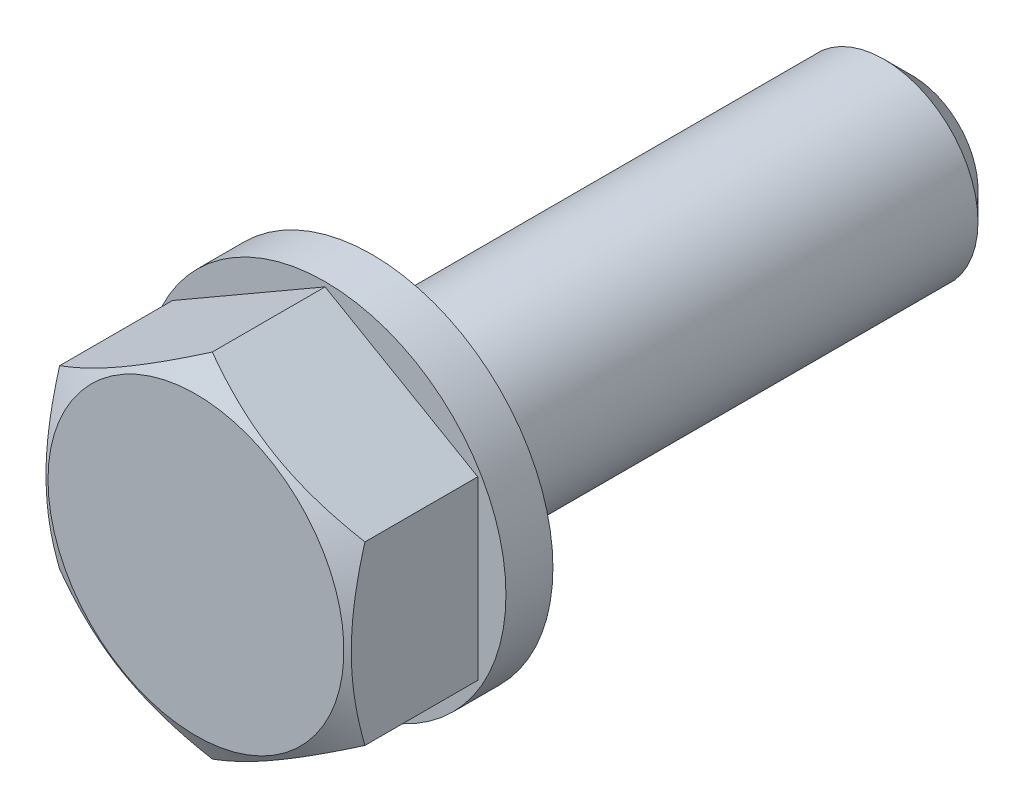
ISO-10303-21;
HEADER;
FILE_DESCRIPTION(('STEP AP214'),'2;1');
FILE_NAME('part.step','',(''),(''),'','','');
FILE_SCHEMA(('AUTOMOTIVE_DESIGN { 1 0 10303 214 1 1 1 1 }'));
ENDSEC;
DATA;
#1=APPLICATION_CONTEXT('core data for automotive mechanical design processes');
#2=APPLICATION_PROTOCOL_DEFINITION('international standard','automotive_design',2000,#1);
#3=PRODUCT_CONTEXT('',#1,'mechanical');
#4=PRODUCT('Part','Part','',(#3));
#5=PRODUCT_RELATED_PRODUCT_CATEGORY('part','',(#4));
#6=PRODUCT_DEFINITION_FORMATION('','',#4);
#7=PRODUCT_DEFINITION_CONTEXT('part definition',#1,'design');
#8=PRODUCT_DEFINITION('design','',#6,#7);
#9=PRODUCT_DEFINITION_SHAPE('','',#8);
#10=(LENGTH_UNIT() NAMED_UNIT(*) SI_UNIT(.MILLI.,.METRE.));
#11=(NAMED_UNIT(*) PLANE_ANGLE_UNIT() SI_UNIT($,.RADIAN.));
#12=(NAMED_UNIT(*) SI_UNIT($,.STERADIAN.) SOLID_ANGLE_UNIT());
#13=UNCERTAINTY_MEASURE_WITH_UNIT(LENGTH_MEASURE(1.E-05),#10,'distance_accuracy_value','');
#14=(GEOMETRIC_REPRESENTATION_CONTEXT(3) GLOBAL_UNCERTAINTY_ASSIGNED_CONTEXT((#13)) GLOBAL_UNIT_ASSIGNED_CONTEXT((#10,
#11,#12)) REPRESENTATION_CONTEXT('',''));
#15=CARTESIAN_POINT('',(0.,0.,0.));
#16=DIRECTION('',(0.,0.,1.));
#17=DIRECTION('',(1.,0.,0.));
#18=AXIS2_PLACEMENT_3D('',#15,#16,#17);
#19=CARTESIAN_POINT('',(0.,7.50555349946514,0.));
#20=DIRECTION('',(0.,0.,1.));
#21=DIRECTION('',(1.,0.,0.));
#22=AXIS2_PLACEMENT_3D('',#19,#20,#21);
#23=PLANE('',#22);
#24=CARTESIAN_POINT('',(0.,0.,0.));
#25=DIRECTION('',(0.,0.,-1.));
#26=DIRECTION('',(-1.,0.,0.));
#27=AXIS2_PLACEMENT_3D('',#24,#25,#26);
#28=CIRCLE('',#27,4.1);
#29=CARTESIAN_POINT('',(-4.1,0.,0.));
#30=VERTEX_POINT('',#29);
#31=EDGE_CURVE('E338',#30,#30,#28,.T.);
#32=ORIENTED_EDGE('',*,*,#31,.T.);
#33=EDGE_LOOP('',(#32));
#34=FACE_BOUND('',#33,.T.);
#35=CARTESIAN_POINT('',(0.,0.,0.));
#36=DIRECTION('',(0.,0.,1.));
#37=DIRECTION('',(1.,0.,0.));
#38=AXIS2_PLACEMENT_3D('',#35,#36,#37);
#39=CIRCLE('',#38,4.);
#40=CARTESIAN_POINT('',(4.,0.,0.));
#41=VERTEX_POINT('',#40);
#42=EDGE_CURVE('E102',#41,#41,#39,.F.);
#43=ORIENTED_EDGE('',*,*,#42,.F.);
#44=EDGE_LOOP('',(#43));
#45=FACE_BOUND('',#44,.T.);
#46=ADVANCED_FACE('F14',(#34,#45),#23,.F.);
#47=CARTESIAN_POINT('',(0.,0.,-25.));
#48=DIRECTION('',(0.,0.,1.));
#49=DIRECTION('',(1.,0.,0.));
#50=AXIS2_PLACEMENT_3D('',#47,#48,#49);
#51=CYLINDRICAL_SURFACE('',#50,4.);
#52=CARTESIAN_POINT('',(0.,0.,-23.8));
#53=DIRECTION('',(0.,0.,-1.));
#54=DIRECTION('',(-1.,0.,0.));
#55=AXIS2_PLACEMENT_3D('',#52,#53,#54);
#56=CIRCLE('',#55,4.);
#57=CARTESIAN_POINT('',(-4.,0.,-23.8));
#58=VERTEX_POINT('',#57);
#59=EDGE_CURVE('E9',#58,#58,#56,.F.);
#60=ORIENTED_EDGE('',*,*,#59,.T.);
#61=EDGE_LOOP('',(#60));
#62=FACE_BOUND('',#61,.T.);
#63=ORIENTED_EDGE('',*,*,#42,.T.);
#64=EDGE_LOOP('',(#63));
#65=FACE_BOUND('',#64,.T.);
#66=ADVANCED_FACE('F120',(#62,#65),#51,.T.);
#67=CARTESIAN_POINT('',(0.,0.,-25.));
#68=DIRECTION('',(0.,0.,-1.));
#69=DIRECTION('',(-1.,0.,0.));
#70=AXIS2_PLACEMENT_3D('',#67,#68,#69);
#71=PLANE('',#70);
#72=CARTESIAN_POINT('',(0.,0.,-25.));
#73=DIRECTION('',(0.,0.,-1.));
#74=DIRECTION('',(-1.,0.,0.));
#75=AXIS2_PLACEMENT_3D('',#72,#73,#74);
#76=CIRCLE('',#75,2.8);
#77=CARTESIAN_POINT('',(-2.8,0.,-25.));
#78=VERTEX_POINT('',#77);
#79=EDGE_CURVE('E22',#78,#78,#76,.T.);
#80=ORIENTED_EDGE('',*,*,#79,.T.);
#81=EDGE_LOOP('',(#80));
#82=FACE_BOUND('',#81,.T.);
#83=ADVANCED_FACE('F107',(#82),#71,.T.);
#84=CARTESIAN_POINT('',(0.,0.,-25.));
#85=DIRECTION('',(0.,0.,1.));
#86=DIRECTION('',(1.,0.,0.));
#87=AXIS2_PLACEMENT_3D('',#84,#85,#86);
#88=CONICAL_SURFACE('',#87,2.8,0.785398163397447);
#89=ORIENTED_EDGE('',*,*,#59,.F.);
#90=EDGE_LOOP('',(#89));
#91=FACE_BOUND('',#90,.T.);
#92=ORIENTED_EDGE('',*,*,#79,.F.);
#93=EDGE_LOOP('',(#92));
#94=FACE_BOUND('',#93,.T.);
#95=ADVANCED_FACE('F16',(#91,#94),#88,.T.);
#96=CARTESIAN_POINT('',(0.,0.,0.));
#97=DIRECTION('',(0.,0.,-1.));
#98=DIRECTION('',(-1.,0.,0.));
#99=AXIS2_PLACEMENT_3D('',#96,#97,#98);
#100=PLANE('',#99);
#101=CARTESIAN_POINT('',(0.,0.,0.));
#102=DIRECTION('',(0.,0.,-1.));
#103=DIRECTION('',(-1.,0.,0.));
#104=AXIS2_PLACEMENT_3D('',#101,#102,#103);
#105=CIRCLE('',#104,7.7);
#106=CARTESIAN_POINT('',(-7.7,0.,0.));
#107=VERTEX_POINT('',#106);
#108=EDGE_CURVE('E337',#107,#107,#105,.T.);
#109=ORIENTED_EDGE('',*,*,#108,.F.);
#110=EDGE_LOOP('',(#109));
#111=FACE_BOUND('',#110,.T.);
#112=DIRECTION('',(-0.866025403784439,-0.5,0.));
#113=VECTOR('',#112,1.);
#114=CARTESIAN_POINT('',(0.,7.50555349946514,0.));
#115=LINE('',#114,#113);
#116=CARTESIAN_POINT('',(0.,7.50555349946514,0.));
#117=VERTEX_POINT('',#116);
#118=CARTESIAN_POINT('',(-6.5,3.75277674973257,0.));
#119=VERTEX_POINT('',#118);
#120=EDGE_CURVE('E210',#117,#119,#115,.T.);
#121=ORIENTED_EDGE('',*,*,#120,.F.);
#122=DIRECTION('',(-0.866025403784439,0.5,0.));
#123=VECTOR('',#122,1.);
#124=CARTESIAN_POINT('',(6.5,3.75277674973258,0.));
#125=LINE('',#124,#123);
#126=CARTESIAN_POINT('',(6.5,3.75277674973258,0.));
#127=VERTEX_POINT('',#126);
#128=EDGE_CURVE('E37',#127,#117,#125,.T.);
#129=ORIENTED_EDGE('',*,*,#128,.F.);
#130=DIRECTION('',(0.,1.,0.));
#131=VECTOR('',#130,1.);
#132=CARTESIAN_POINT('',(6.5,-3.75277674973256,0.));
#133=LINE('',#132,#131);
#134=CARTESIAN_POINT('',(6.5,-3.75277674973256,0.));
#135=VERTEX_POINT('',#134);
#136=EDGE_CURVE('E65',#135,#127,#133,.T.);
#137=ORIENTED_EDGE('',*,*,#136,.F.);
#138=DIRECTION('',(0.866025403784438,0.5,0.));
#139=VECTOR('',#138,1.);
#140=CARTESIAN_POINT('',(0.,-7.50555349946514,0.));
#141=LINE('',#140,#139);
#142=CARTESIAN_POINT('',(0.,-7.50555349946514,0.));
#143=VERTEX_POINT('',#142);
#144=EDGE_CURVE('E69',#143,#135,#141,.T.);
#145=ORIENTED_EDGE('',*,*,#144,.F.);
#146=DIRECTION('',(0.866025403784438,-0.5,0.));
#147=VECTOR('',#146,1.);
#148=CARTESIAN_POINT('',(-6.5,-3.75277674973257,0.));
#149=LINE('',#148,#147);
#150=CARTESIAN_POINT('',(-6.5,-3.75277674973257,0.));
#151=VERTEX_POINT('',#150);
#152=EDGE_CURVE('E85',#151,#143,#149,.T.);
#153=ORIENTED_EDGE('',*,*,#152,.F.);
#154=DIRECTION('',(0.,-1.,0.));
#155=VECTOR('',#154,1.);
#156=CARTESIAN_POINT('',(-6.5,3.75277674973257,0.));
#157=LINE('',#156,#155);
#158=EDGE_CURVE('E87',#119,#151,#157,.T.);
#159=ORIENTED_EDGE('',*,*,#158,.F.);
#160=EDGE_LOOP('',(#121,#129,#137,#145,#153,#159));
#161=FACE_BOUND('',#160,.T.);
#162=ADVANCED_FACE('F67',(#111,#161),#100,.F.);
#163=CARTESIAN_POINT('',(0.,0.,-2.));
#164=DIRECTION('',(0.,0.,-1.));
#165=DIRECTION('',(-1.,0.,0.));
#166=AXIS2_PLACEMENT_3D('',#163,#164,#165);
#167=PLANE('',#166);
#168=CARTESIAN_POINT('',(0.,0.,-2.));
#169=DIRECTION('',(0.,0.,-1.));
#170=DIRECTION('',(-1.,0.,0.));
#171=AXIS2_PLACEMENT_3D('',#168,#169,#170);
#172=CIRCLE('',#171,7.7);
#173=CARTESIAN_POINT('',(-7.7,0.,-2.));
#174=VERTEX_POINT('',#173);
#175=EDGE_CURVE('E333',#174,#174,#172,.T.);
#176=ORIENTED_EDGE('',*,*,#175,.T.);
#177=EDGE_LOOP('',(#176));
#178=FACE_BOUND('',#177,.T.);
#179=CARTESIAN_POINT('',(0.,0.,-2.));
#180=DIRECTION('',(0.,0.,-1.));
#181=DIRECTION('',(-1.,0.,0.));
#182=AXIS2_PLACEMENT_3D('',#179,#180,#181);
#183=CIRCLE('',#182,4.1);
#184=CARTESIAN_POINT('',(-4.1,0.,-2.));
#185=VERTEX_POINT('',#184);
#186=EDGE_CURVE('E336',#185,#185,#183,.T.);
#187=ORIENTED_EDGE('',*,*,#186,.F.);
#188=EDGE_LOOP('',(#187));
#189=FACE_BOUND('',#188,.T.);
#190=ADVANCED_FACE('F117',(#178,#189),#167,.T.);
#191=CARTESIAN_POINT('',(0.,0.,-2.));
#192=DIRECTION('',(0.,0.,1.));
#193=DIRECTION('',(1.,0.,0.));
#194=AXIS2_PLACEMENT_3D('',#191,#192,#193);
#195=CYLINDRICAL_SURFACE('',#194,7.7);
#196=ORIENTED_EDGE('',*,*,#175,.F.);
#197=EDGE_LOOP('',(#196));
#198=FACE_BOUND('',#197,.T.);
#199=ORIENTED_EDGE('',*,*,#108,.T.);
#200=EDGE_LOOP('',(#199));
#201=FACE_BOUND('',#200,.T.);
#202=ADVANCED_FACE('F260',(#198,#201),#195,.T.);
#203=CARTESIAN_POINT('',(0.,0.,-2.));
#204=DIRECTION('',(0.,0.,1.));
#205=DIRECTION('',(1.,0.,0.));
#206=AXIS2_PLACEMENT_3D('',#203,#204,#205);
#207=CYLINDRICAL_SURFACE('',#206,4.1);
#208=ORIENTED_EDGE('',*,*,#186,.T.);
#209=EDGE_LOOP('',(#208));
#210=FACE_BOUND('',#209,.T.);
#211=ORIENTED_EDGE('',*,*,#31,.F.);
#212=EDGE_LOOP('',(#211));
#213=FACE_BOUND('',#212,.T.);
#214=ADVANCED_FACE('F252',(#210,#213),#207,.F.);
#215=CARTESIAN_POINT('',(0.,7.50555349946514,5.5));
#216=DIRECTION('',(0.,0.,1.));
#217=DIRECTION('',(1.,0.,0.));
#218=AXIS2_PLACEMENT_3D('',#215,#216,#217);
#219=PLANE('',#218);
#220=CARTESIAN_POINT('',(0.,0.,5.5));
#221=DIRECTION('',(0.,0.,-1.));
#222=DIRECTION('',(-1.,0.,0.));
#223=AXIS2_PLACEMENT_3D('',#220,#221,#222);
#224=CIRCLE('',#223,6.3);
#225=CARTESIAN_POINT('',(-6.3,0.,5.5));
#226=VERTEX_POINT('',#225);
#227=EDGE_CURVE('E151',#226,#226,#224,.T.);
#228=ORIENTED_EDGE('',*,*,#227,.F.);
#229=EDGE_LOOP('',(#228));
#230=FACE_BOUND('',#229,.T.);
#231=ADVANCED_FACE('F136',(#230),#219,.T.);
#232=CARTESIAN_POINT('',(0.,0.,5.5));
#233=DIRECTION('',(0.,0.,-1.));
#234=DIRECTION('',(-1.,0.,0.));
#235=AXIS2_PLACEMENT_3D('',#232,#233,#234);
#236=CONICAL_SURFACE('',#235,6.3,1.0471975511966);
#237=ORIENTED_EDGE('',*,*,#227,.T.);
#238=EDGE_LOOP('',(#237));
#239=FACE_BOUND('',#238,.T.);
#240=CARTESIAN_POINT('',(-6.5002,3.75266127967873,4.80390669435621));
#241=CARTESIAN_POINT('',(-6.35732254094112,3.83515161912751,4.85152552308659));
#242=CARTESIAN_POINT('',(-6.21391236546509,3.91794952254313,4.89698324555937));
#243=CARTESIAN_POINT('',(-5.92592736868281,4.08421773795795,4.98298126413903));
#244=CARTESIAN_POINT('',(-5.78135207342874,4.16768832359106,5.02351943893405));
#245=CARTESIAN_POINT('',(-5.34531134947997,4.41943655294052,5.13695894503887));
#246=CARTESIAN_POINT('',(-5.05212471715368,4.5887079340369,5.20148213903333));
#247=CARTESIAN_POINT('',(-4.61337625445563,4.84201947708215,5.27714336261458));
#248=CARTESIAN_POINT('',(-4.46912536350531,4.92530276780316,5.29869708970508));
#249=CARTESIAN_POINT('',(-4.17997178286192,5.09224566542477,5.33483963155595));
#250=CARTESIAN_POINT('',(-4.03506915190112,5.17590523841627,5.34942906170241));
#251=CARTESIAN_POINT('',(-3.74501222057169,5.34336968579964,5.37127119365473));
#252=CARTESIAN_POINT('',(-3.5998583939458,5.427174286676,5.37853222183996));
#253=CARTESIAN_POINT('',(-3.30942466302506,5.59485627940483,5.38556964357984));
#254=CARTESIAN_POINT('',(-3.16414476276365,5.6787336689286,5.38534626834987));
#255=CARTESIAN_POINT('',(-2.76612405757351,5.90853103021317,5.37444648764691));
#256=CARTESIAN_POINT('',(-2.51351353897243,6.05437578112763,5.35614812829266));
#257=CARTESIAN_POINT('',(-2.00997032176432,6.34509659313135,5.2981236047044));
#258=CARTESIAN_POINT('',(-1.75903939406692,6.48997163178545,5.25837760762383));
#259=CARTESIAN_POINT('',(-1.25448277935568,6.78127752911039,5.15902404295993));
#260=CARTESIAN_POINT('',(-1.00092075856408,6.92767163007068,5.09899552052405));
#261=CARTESIAN_POINT('',(-0.497578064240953,7.21827667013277,4.9627549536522));
#262=CARTESIAN_POINT('',(-0.247790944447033,7.36249133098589,4.88657491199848));
#263=CARTESIAN_POINT('',(0.000200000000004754,7.50566896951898,4.80390669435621));
#264=B_SPLINE_CURVE_WITH_KNOTS('',3,(#240,#241,#242,#243,#244,#245,#246,#247,#248,#249,#250,
#251,#252,#253,#254,#255,#256,#257,#258,#259,#260,#261,#262,#263),.UNSPECIFIED.,.F.,.F.,(4,2,2,
2,2,2,2,2,2,2,2,4),(0.,0.515105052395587,1.03043143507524,2.06322554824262,2.56697389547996,
3.07067772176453,3.57380860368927,4.07692394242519,4.9527935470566,5.82947446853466,
6.72559912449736,7.61996451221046),.UNSPECIFIED.);
#265=CARTESIAN_POINT('',(-6.5,3.75277674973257,4.80397336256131));
#266=VERTEX_POINT('',#265);
#267=CARTESIAN_POINT('',(0.,7.50555349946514,4.80397336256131));
#268=VERTEX_POINT('',#267);
#269=EDGE_CURVE('E180',#266,#268,#264,.T.);
#270=ORIENTED_EDGE('',*,*,#269,.F.);
#271=CARTESIAN_POINT('',(-6.5,-10.0121745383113,2.24543614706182));
#272=CARTESIAN_POINT('',(-6.5,-9.72884077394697,2.38260259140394));
#273=CARTESIAN_POINT('',(-6.50000000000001,-9.44484920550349,2.51843391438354));
#274=CARTESIAN_POINT('',(-6.50000000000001,-8.87520038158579,2.7866740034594));
#275=CARTESIAN_POINT('',(-6.50000000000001,-8.58954286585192,2.91908221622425));
#276=CARTESIAN_POINT('',(-6.50000000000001,-8.01470725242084,3.18040459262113));
#277=CARTESIAN_POINT('',(-6.50000000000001,-7.72551840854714,3.30929520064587));
#278=CARTESIAN_POINT('',(-6.50000000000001,-7.14481653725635,3.56170967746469));
#279=CARTESIAN_POINT('',(-6.5,-6.85330362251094,3.68523380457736));
#280=CARTESIAN_POINT('',(-6.5,-6.25835021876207,3.92924476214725));
#281=CARTESIAN_POINT('',(-6.5,-5.95482118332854,4.0495168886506));
#282=CARTESIAN_POINT('',(-6.5,-5.34418660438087,4.28079198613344));
#283=CARTESIAN_POINT('',(-6.5,-5.03708066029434,4.39179390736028));
#284=CARTESIAN_POINT('',(-6.5,-4.41940212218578,4.6015647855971));
#285=CARTESIAN_POINT('',(-6.5,-4.10883822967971,4.70035910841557));
#286=CARTESIAN_POINT('',(-6.5,-3.48325330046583,4.88249853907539));
#287=CARTESIAN_POINT('',(-6.5,-3.1682337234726,4.96584858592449));
#288=CARTESIAN_POINT('',(-6.5,-2.53530790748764,5.11261969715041));
#289=CARTESIAN_POINT('',(-6.5,-2.21742650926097,5.1761461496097));
#290=CARTESIAN_POINT('',(-6.5,-1.57773861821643,5.27961655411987));
#291=CARTESIAN_POINT('',(-6.5,-1.25593247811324,5.31956260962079));
#292=CARTESIAN_POINT('',(-6.5,-0.773694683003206,5.35914225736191));
#293=CARTESIAN_POINT('',(-6.5,-0.614056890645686,5.36894628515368));
#294=CARTESIAN_POINT('',(-6.5,-0.294502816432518,5.38180549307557));
#295=CARTESIAN_POINT('',(-6.5,-0.134586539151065,5.38486078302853));
#296=CARTESIAN_POINT('',(-6.5,0.185230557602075,5.38414215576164));
#297=CARTESIAN_POINT('',(-6.5,0.345131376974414,5.38036819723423));
#298=CARTESIAN_POINT('',(-6.5,0.664634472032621,5.36608412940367));
#299=CARTESIAN_POINT('',(-6.5,0.824236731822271,5.35557367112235));
#300=CARTESIAN_POINT('',(-6.5,1.20990407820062,5.32225600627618));
#301=CARTESIAN_POINT('',(-6.5,1.43568874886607,5.29613611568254));
#302=CARTESIAN_POINT('',(-6.5,1.885526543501,5.23185497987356));
#303=CARTESIAN_POINT('',(-6.5,2.10957941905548,5.19369203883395));
#304=CARTESIAN_POINT('',(-6.5,2.77891557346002,5.06316700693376));
#305=CARTESIAN_POINT('',(-6.5,3.22111483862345,4.95479423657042));
#306=CARTESIAN_POINT('',(-6.5,3.88223039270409,4.76757229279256));
#307=CARTESIAN_POINT('',(-6.5,4.10459338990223,4.70020011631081));
#308=CARTESIAN_POINT('',(-6.5,4.54715853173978,4.55863430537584));
#309=CARTESIAN_POINT('',(-6.5,4.767360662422,4.48444062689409));
#310=CARTESIAN_POINT('',(-6.5,5.20567675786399,4.33040752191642));
#311=CARTESIAN_POINT('',(-6.5,5.42379142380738,4.25057007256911));
#312=CARTESIAN_POINT('',(-6.5,5.85822557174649,4.08617118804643));
#313=CARTESIAN_POINT('',(-6.5,6.07454507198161,4.0016098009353));
#314=CARTESIAN_POINT('',(-6.5,6.5732891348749,3.80137016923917));
#315=CARTESIAN_POINT('',(-6.5,6.85513768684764,3.68426014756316));
#316=CARTESIAN_POINT('',(-6.5,7.41653666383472,3.44464123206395));
#317=CARTESIAN_POINT('',(-6.5,7.69608696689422,3.32213205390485));
#318=CARTESIAN_POINT('',(-6.5,8.25329746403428,3.07276664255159));
#319=CARTESIAN_POINT('',(-6.5,8.5309573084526,2.94590963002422));
#320=CARTESIAN_POINT('',(-6.5,9.08465216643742,2.6886919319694));
#321=CARTESIAN_POINT('',(-6.5,9.36068714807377,2.5583311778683));
#322=CARTESIAN_POINT('',(-6.5,9.91163626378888,2.29462745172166));
#323=CARTESIAN_POINT('',(-6.5,10.1865491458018,2.16128186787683));
#324=CARTESIAN_POINT('',(-6.5,10.7352128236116,1.89221900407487));
#325=CARTESIAN_POINT('',(-6.5,11.0089636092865,1.75650170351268));
#326=CARTESIAN_POINT('',(-6.5,11.8287554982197,1.3464007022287));
#327=CARTESIAN_POINT('',(-6.5,12.3733247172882,1.0690734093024));
#328=CARTESIAN_POINT('',(-6.5,13.1662023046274,0.660151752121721));
#329=CARTESIAN_POINT('',(-6.5,13.4156505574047,0.530753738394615));
#330=CARTESIAN_POINT('',(-6.5,13.9140050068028,0.270927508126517));
#331=CARTESIAN_POINT('',(-6.49999999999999,14.1629112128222,0.140499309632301));
#332=CARTESIAN_POINT('',(-6.49999999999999,14.9089444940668,-0.252133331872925));
#333=CARTESIAN_POINT('',(-6.49999999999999,15.4053671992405,-0.515675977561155));
#334=CARTESIAN_POINT('',(-6.49999999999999,16.3956060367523,-1.0448805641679));
#335=CARTESIAN_POINT('',(-6.49999999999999,16.8894255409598,-1.31053620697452));
#336=CARTESIAN_POINT('',(-6.49999999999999,17.8758673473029,-1.8440018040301));
#337=CARTESIAN_POINT('',(-6.5,18.3684897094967,-2.11181164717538));
#338=CARTESIAN_POINT('',(-6.5,18.8606678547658,-2.3804302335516));
#339=B_SPLINE_CURVE_WITH_KNOTS('',3,(#271,#272,#273,#274,#275,#276,#277,#278,#279,#280,#281,
#282,#283,#284,#285,#286,#287,#288,#289,#290,#291,#292,#293,#294,#295,#296,#297,#298,#299,#300,
#301,#302,#303,#304,#305,#306,#307,#308,#309,#310,#311,#312,#313,#314,#315,#316,#317,#318,#319,
#320,#321,#322,#323,#324,#325,#326,#327,#328,#329,#330,#331,#332,#333,#334,#335,#336,#337,#338),
.UNSPECIFIED.,.F.,.F.,(4,2,2,2,2,2,2,2,2,2,2,2,2,2,2,2,2,2,2,2,2,2,2,2,2,2,2,2,2,2,2,2,2,4),(0.,
0.944381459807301,1.88891463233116,2.83870615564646,3.78845190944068,4.76780293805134,
5.74726471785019,6.72465579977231,7.70173377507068,8.67352515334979,9.64522983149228,
10.1249245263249,10.6046114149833,11.0843012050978,11.5640158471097,12.2455009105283,
12.9270819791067,14.291028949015,14.9880088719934,15.6849932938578,16.3817347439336,
17.0784691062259,17.9940256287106,18.9096304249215,19.8254002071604,20.741187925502,
21.6578109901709,22.5744420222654,24.4077421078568,25.2507801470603,26.0938034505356,
27.779914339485,29.4621322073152,31.1442638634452),.UNSPECIFIED.);
#340=CARTESIAN_POINT('',(-6.5,-3.75277674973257,4.80397336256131));
#341=VERTEX_POINT('',#340);
#342=EDGE_CURVE('E173',#341,#266,#339,.T.);
#343=ORIENTED_EDGE('',*,*,#342,.F.);
#344=CARTESIAN_POINT('',(0.000199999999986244,-7.50566896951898,4.80390669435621));
#345=CARTESIAN_POINT('',(-0.142677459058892,-7.4231786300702,4.85152552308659));
#346=CARTESIAN_POINT('',(-0.286087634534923,-7.34038072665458,4.89698324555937));
#347=CARTESIAN_POINT('',(-0.574072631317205,-7.17411251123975,4.98298126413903));
#348=CARTESIAN_POINT('',(-0.718647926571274,-7.09064192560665,5.02351943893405));
#349=CARTESIAN_POINT('',(-1.15468865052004,-6.83889369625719,5.13695894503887));
#350=CARTESIAN_POINT('',(-1.44787528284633,-6.6696223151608,5.20148213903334));
#351=CARTESIAN_POINT('',(-1.88662374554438,-6.41631077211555,5.27714336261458));
#352=CARTESIAN_POINT('',(-2.0308746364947,-6.33302748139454,5.29869708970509));
#353=CARTESIAN_POINT('',(-2.3200282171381,-6.16608458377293,5.33483963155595));
#354=CARTESIAN_POINT('',(-2.4649308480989,-6.08242501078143,5.34942906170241));
#355=CARTESIAN_POINT('',(-2.75498777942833,-5.91496056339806,5.37127119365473));
#356=CARTESIAN_POINT('',(-2.90014160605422,-5.8311559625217,5.37853222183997));
#357=CARTESIAN_POINT('',(-3.19057533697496,-5.66347396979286,5.38556964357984));
#358=CARTESIAN_POINT('',(-3.33585523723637,-5.5795965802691,5.38534626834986));
#359=CARTESIAN_POINT('',(-3.73387594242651,-5.34979921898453,5.3744464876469));
#360=CARTESIAN_POINT('',(-3.98648646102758,-5.20395446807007,5.35614812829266));
#361=CARTESIAN_POINT('',(-4.49002967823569,-4.91323365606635,5.2981236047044));
#362=CARTESIAN_POINT('',(-4.74096060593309,-4.76835861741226,5.25837760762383));
#363=CARTESIAN_POINT('',(-5.24551722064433,-4.47705272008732,5.15902404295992));
#364=CARTESIAN_POINT('',(-5.49907924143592,-4.33065861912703,5.09899552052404));
#365=CARTESIAN_POINT('',(-6.00242193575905,-4.04005357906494,4.96275495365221));
#366=CARTESIAN_POINT('',(-6.25220905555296,-3.89583891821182,4.88657491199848));
#367=CARTESIAN_POINT('',(-6.5002,-3.75266127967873,4.80390669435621));
#368=B_SPLINE_CURVE_WITH_KNOTS('',3,(#344,#345,#346,#347,#348,#349,#350,#351,#352,#353,#354,
#355,#356,#357,#358,#359,#360,#361,#362,#363,#364,#365,#366,#367),.UNSPECIFIED.,.F.,.F.,(4,2,2,
2,2,2,2,2,2,2,2,4),(0.,0.515105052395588,1.03043143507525,2.06322554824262,2.56697389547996,
3.07067772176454,3.57380860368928,4.0769239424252,4.9527935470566,5.82947446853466,
6.72559912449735,7.61996451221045),.UNSPECIFIED.);
#369=CARTESIAN_POINT('',(0.,-7.50555349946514,4.80397336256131));
#370=VERTEX_POINT('',#369);
#371=EDGE_CURVE('E167',#370,#341,#368,.T.);
#372=ORIENTED_EDGE('',*,*,#371,.F.);
#373=CARTESIAN_POINT('',(6.5002,-3.75266127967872,4.80390669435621));
#374=CARTESIAN_POINT('',(6.35732254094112,-3.8351516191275,4.85152552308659));
#375=CARTESIAN_POINT('',(6.21391236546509,-3.91794952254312,4.89698324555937));
#376=CARTESIAN_POINT('',(5.92592736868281,-4.08421773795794,4.98298126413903));
#377=CARTESIAN_POINT('',(5.78135207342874,-4.16768832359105,5.02351943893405));
#378=CARTESIAN_POINT('',(5.34531134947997,-4.41943655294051,5.13695894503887));
#379=CARTESIAN_POINT('',(5.05212471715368,-4.58870793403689,5.20148213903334));
#380=CARTESIAN_POINT('',(4.61337625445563,-4.84201947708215,5.27714336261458));
#381=CARTESIAN_POINT('',(4.46912536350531,-4.92530276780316,5.29869708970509));
#382=CARTESIAN_POINT('',(4.17997178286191,-5.09224566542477,5.33483963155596));
#383=CARTESIAN_POINT('',(4.03506915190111,-5.17590523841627,5.34942906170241));
#384=CARTESIAN_POINT('',(3.74501222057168,-5.34336968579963,5.37127119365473));
#385=CARTESIAN_POINT('',(3.59985839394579,-5.42717428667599,5.37853222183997));
#386=CARTESIAN_POINT('',(3.30942466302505,-5.59485627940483,5.38556964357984));
#387=CARTESIAN_POINT('',(3.16414476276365,-5.6787336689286,5.38534626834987));
#388=CARTESIAN_POINT('',(2.76612405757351,-5.90853103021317,5.37444648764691));
#389=CARTESIAN_POINT('',(2.51351353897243,-6.05437578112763,5.35614812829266));
#390=CARTESIAN_POINT('',(2.00997032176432,-6.34509659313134,5.2981236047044));
#391=CARTESIAN_POINT('',(1.75903939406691,-6.48997163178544,5.25837760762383));
#392=CARTESIAN_POINT('',(1.25448277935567,-6.78127752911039,5.15902404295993));
#393=CARTESIAN_POINT('',(1.00092075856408,-6.92767163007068,5.09899552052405));
#394=CARTESIAN_POINT('',(0.497578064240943,-7.21827667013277,4.9627549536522));
#395=CARTESIAN_POINT('',(0.247790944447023,-7.36249133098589,4.88657491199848));
#396=CARTESIAN_POINT('',(-0.000200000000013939,-7.50566896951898,4.80390669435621));
#397=B_SPLINE_CURVE_WITH_KNOTS('',3,(#373,#374,#375,#376,#377,#378,#379,#380,#381,#382,#383,
#384,#385,#386,#387,#388,#389,#390,#391,#392,#393,#394,#395,#396),.UNSPECIFIED.,.F.,.F.,(4,2,2,
2,2,2,2,2,2,2,2,4),(0.,0.515105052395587,1.03043143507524,2.06322554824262,2.56697389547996,
3.07067772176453,3.57380860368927,4.0769239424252,4.9527935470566,5.82947446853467,
6.72559912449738,7.61996451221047),.UNSPECIFIED.);
#398=CARTESIAN_POINT('',(6.5,-3.75277674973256,4.80397336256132));
#399=VERTEX_POINT('',#398);
#400=EDGE_CURVE('E29',#399,#370,#397,.T.);
#401=ORIENTED_EDGE('',*,*,#400,.F.);
#402=CARTESIAN_POINT('',(6.5,-10.012174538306,2.24543614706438));
#403=CARTESIAN_POINT('',(6.5,-9.72884077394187,2.38260259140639));
#404=CARTESIAN_POINT('',(6.5,-9.44484920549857,2.51843391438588));
#405=CARTESIAN_POINT('',(6.5,-8.87520038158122,2.78667400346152));
#406=CARTESIAN_POINT('',(6.5,-8.58954286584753,2.91908221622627));
#407=CARTESIAN_POINT('',(6.5,-8.01470725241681,3.18040459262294));
#408=CARTESIAN_POINT('',(6.5,-7.72551840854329,3.30929520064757));
#409=CARTESIAN_POINT('',(6.5,-7.14481653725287,3.56170967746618));
#410=CARTESIAN_POINT('',(6.5,-6.85330362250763,3.68523380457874));
#411=CARTESIAN_POINT('',(6.5,-6.25835021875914,3.92924476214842));
#412=CARTESIAN_POINT('',(6.5,-5.95482118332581,4.04951688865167));
#413=CARTESIAN_POINT('',(6.5,-5.34418660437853,4.2807919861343));
#414=CARTESIAN_POINT('',(6.5,-5.0370806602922,4.39179390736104));
#415=CARTESIAN_POINT('',(6.5,-4.41940212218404,4.60156478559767));
#416=CARTESIAN_POINT('',(6.5,-4.10883822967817,4.70035910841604));
#417=CARTESIAN_POINT('',(6.5,-3.4832533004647,4.8824985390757));
#418=CARTESIAN_POINT('',(6.5,-3.16823372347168,4.96584858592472));
#419=CARTESIAN_POINT('',(6.5,-2.53530790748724,5.11261969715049));
#420=CARTESIAN_POINT('',(6.5,-2.21742650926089,5.17614614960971));
#421=CARTESIAN_POINT('',(6.5,-1.57773861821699,5.27961655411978));
#422=CARTESIAN_POINT('',(6.5,-1.25593247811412,5.31956260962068));
#423=CARTESIAN_POINT('',(6.5,-0.773694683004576,5.35914225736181));
#424=CARTESIAN_POINT('',(6.5,-0.614056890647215,5.3689462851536));
#425=CARTESIAN_POINT('',(6.5,-0.294502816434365,5.38180549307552));
#426=CARTESIAN_POINT('',(6.5,-0.134586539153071,5.3848607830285));
#427=CARTESIAN_POINT('',(6.5,0.185230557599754,5.38414215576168));
#428=CARTESIAN_POINT('',(6.5,0.345131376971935,5.3803681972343));
#429=CARTESIAN_POINT('',(6.5,0.66463447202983,5.36608412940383));
#430=CARTESIAN_POINT('',(6.5,0.824236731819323,5.35557367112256));
#431=CARTESIAN_POINT('',(6.5,1.20990407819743,5.32225600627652));
#432=CARTESIAN_POINT('',(6.5,1.43568874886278,5.29613611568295));
#433=CARTESIAN_POINT('',(6.5,1.88552654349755,5.23185497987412));
#434=CARTESIAN_POINT('',(6.5,2.10957941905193,5.19369203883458));
#435=CARTESIAN_POINT('',(6.5,2.77891557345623,5.06316700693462));
#436=CARTESIAN_POINT('',(6.5,3.2211148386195,4.95479423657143));
#437=CARTESIAN_POINT('',(6.5,3.8822303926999,4.76757229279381));
#438=CARTESIAN_POINT('',(6.5,4.10459338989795,4.70020011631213));
#439=CARTESIAN_POINT('',(6.5,4.54715853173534,4.55863430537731));
#440=CARTESIAN_POINT('',(6.5,4.76736066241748,4.48444062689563));
#441=CARTESIAN_POINT('',(6.5,5.2056767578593,4.33040752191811));
#442=CARTESIAN_POINT('',(6.5,5.42379142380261,4.25057007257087));
#443=CARTESIAN_POINT('',(6.5,5.85822557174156,4.08617118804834));
#444=CARTESIAN_POINT('',(6.5,6.0745450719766,4.00160980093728));
#445=CARTESIAN_POINT('',(6.5,6.57328913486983,3.80137016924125));
#446=CARTESIAN_POINT('',(6.5,6.8551376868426,3.68426014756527));
#447=CARTESIAN_POINT('',(6.5,7.41653666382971,3.44464123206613));
#448=CARTESIAN_POINT('',(6.5,7.69608696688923,3.32213205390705));
#449=CARTESIAN_POINT('',(6.5,8.25329746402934,3.07276664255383));
#450=CARTESIAN_POINT('',(6.5,8.53095730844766,2.94590963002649));
#451=CARTESIAN_POINT('',(6.5,9.08465216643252,2.68869193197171));
#452=CARTESIAN_POINT('',(6.5,9.36068714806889,2.55833117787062));
#453=CARTESIAN_POINT('',(6.5,9.91163626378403,2.29462745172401));
#454=CARTESIAN_POINT('',(6.5,10.186549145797,2.16128186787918));
#455=CARTESIAN_POINT('',(6.5,10.7352128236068,1.89221900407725));
#456=CARTESIAN_POINT('',(6.5,11.0089636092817,1.75650170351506));
#457=CARTESIAN_POINT('',(6.5,11.8287554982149,1.34640070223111));
#458=CARTESIAN_POINT('',(6.5,12.3733247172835,1.06907340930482));
#459=CARTESIAN_POINT('',(6.5,13.1662023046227,0.660151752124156));
#460=CARTESIAN_POINT('',(6.5,13.4156505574,0.530753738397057));
#461=CARTESIAN_POINT('',(6.5,13.9140050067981,0.270927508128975));
#462=CARTESIAN_POINT('',(6.5,14.1629112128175,0.140499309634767));
#463=CARTESIAN_POINT('',(6.5,14.9089444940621,-0.252133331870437));
#464=CARTESIAN_POINT('',(6.5,15.4053671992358,-0.515675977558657));
#465=CARTESIAN_POINT('',(6.5,16.3956060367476,-1.04488056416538));
#466=CARTESIAN_POINT('',(6.5,16.8894255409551,-1.31053620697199));
#467=CARTESIAN_POINT('',(6.5,17.8758673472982,-1.84400180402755));
#468=CARTESIAN_POINT('',(6.5,18.368489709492,-2.11181164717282));
#469=CARTESIAN_POINT('',(6.5,18.8606678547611,-2.38043023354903));
#470=B_SPLINE_CURVE_WITH_KNOTS('',3,(#402,#403,#404,#405,#406,#407,#408,#409,#410,#411,#412,
#413,#414,#415,#416,#417,#418,#419,#420,#421,#422,#423,#424,#425,#426,#427,#428,#429,#430,#431,
#432,#433,#434,#435,#436,#437,#438,#439,#440,#441,#442,#443,#444,#445,#446,#447,#448,#449,#450,
#451,#452,#453,#454,#455,#456,#457,#458,#459,#460,#461,#462,#463,#464,#465,#466,#467,#468,#469),
.UNSPECIFIED.,.F.,.F.,(4,2,2,2,2,2,2,2,2,2,2,2,2,2,2,2,2,2,2,2,2,2,2,2,2,2,2,2,2,2,2,2,2,4),(0.,
0.94438145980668,1.88891463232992,2.8387061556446,3.78845190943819,4.76780293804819,
5.74726471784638,6.72465579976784,7.70173377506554,8.67352515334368,9.6452298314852,
10.1249245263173,10.6046114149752,11.0843012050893,11.5640158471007,12.245500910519,
12.9270819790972,14.2910289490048,14.9880088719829,15.684993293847,16.3817347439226,
17.0784691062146,17.9940256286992,18.9096304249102,19.8254002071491,20.7411879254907,
21.6578109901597,22.5744420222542,24.4077421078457,25.2507801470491,26.0938034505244,
27.7799143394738,29.462132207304,31.144263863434),.UNSPECIFIED.);
#471=CARTESIAN_POINT('',(6.5,3.75277674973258,4.80397336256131));
#472=VERTEX_POINT('',#471);
#473=EDGE_CURVE('E78',#472,#399,#470,.F.);
#474=ORIENTED_EDGE('',*,*,#473,.F.);
#475=CARTESIAN_POINT('',(-0.00019999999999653,7.50566896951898,4.80390669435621));
#476=CARTESIAN_POINT('',(0.142677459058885,7.42317863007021,4.85152552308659));
#477=CARTESIAN_POINT('',(0.286087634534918,7.34038072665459,4.89698324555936));
#478=CARTESIAN_POINT('',(0.5740726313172,7.17411251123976,4.98298126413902));
#479=CARTESIAN_POINT('',(0.718647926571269,7.09064192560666,5.02351943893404));
#480=CARTESIAN_POINT('',(1.15468865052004,6.8388936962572,5.13695894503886));
#481=CARTESIAN_POINT('',(1.44787528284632,6.66962231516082,5.20148213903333));
#482=CARTESIAN_POINT('',(1.88662374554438,6.41631077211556,5.27714336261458));
#483=CARTESIAN_POINT('',(2.0308746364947,6.33302748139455,5.29869708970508));
#484=CARTESIAN_POINT('',(2.32002821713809,6.16608458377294,5.33483963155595));
#485=CARTESIAN_POINT('',(2.46493084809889,6.08242501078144,5.3494290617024));
#486=CARTESIAN_POINT('',(2.75498777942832,5.91496056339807,5.37127119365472));
#487=CARTESIAN_POINT('',(2.90014160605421,5.83115596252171,5.37853222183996));
#488=CARTESIAN_POINT('',(3.19057533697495,5.66347396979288,5.38556964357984));
#489=CARTESIAN_POINT('',(3.33585523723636,5.57959658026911,5.38534626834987));
#490=CARTESIAN_POINT('',(3.7338759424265,5.34979921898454,5.37444648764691));
#491=CARTESIAN_POINT('',(3.98648646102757,5.20395446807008,5.35614812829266));
#492=CARTESIAN_POINT('',(4.49002967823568,4.91323365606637,5.29812360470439));
#493=CARTESIAN_POINT('',(4.74096060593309,4.76835861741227,5.25837760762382));
#494=CARTESIAN_POINT('',(5.24551722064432,4.47705272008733,5.15902404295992));
#495=CARTESIAN_POINT('',(5.49907924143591,4.33065861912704,5.09899552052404));
#496=CARTESIAN_POINT('',(6.00242193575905,4.04005357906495,4.9627549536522));
#497=CARTESIAN_POINT('',(6.25220905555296,3.89583891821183,4.88657491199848));
#498=CARTESIAN_POINT('',(6.5002,3.75266127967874,4.80390669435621));
#499=B_SPLINE_CURVE_WITH_KNOTS('',3,(#475,#476,#477,#478,#479,#480,#481,#482,#483,#484,#485,
#486,#487,#488,#489,#490,#491,#492,#493,#494,#495,#496,#497,#498),.UNSPECIFIED.,.F.,.F.,(4,2,2,
2,2,2,2,2,2,2,2,4),(0.,0.515105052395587,1.03043143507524,2.06322554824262,2.56697389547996,
3.07067772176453,3.57380860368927,4.0769239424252,4.9527935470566,5.82947446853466,
6.72559912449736,7.61996451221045),.UNSPECIFIED.);
#500=EDGE_CURVE('E187',#268,#472,#499,.T.);
#501=ORIENTED_EDGE('',*,*,#500,.F.);
#502=EDGE_LOOP('',(#270,#343,#372,#401,#474,#501));
#503=FACE_BOUND('',#502,.T.);
#504=ADVANCED_FACE('F141',(#239,#503),#236,.T.);
#505=CARTESIAN_POINT('',(6.5,-3.75277674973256,5.5));
#506=DIRECTION('',(-1.,0.,0.));
#507=DIRECTION('',(0.,0.,1.));
#508=AXIS2_PLACEMENT_3D('',#505,#506,#507);
#509=PLANE('',#508);
#510=DIRECTION('',(0.,0.,-1.));
#511=VECTOR('',#510,1.);
#512=CARTESIAN_POINT('',(6.5,3.75277674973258,5.5));
#513=LINE('',#512,#511);
#514=EDGE_CURVE('E73',#472,#127,#513,.T.);
#515=ORIENTED_EDGE('',*,*,#514,.F.);
#516=ORIENTED_EDGE('',*,*,#473,.T.);
#517=DIRECTION('',(0.,0.,-1.));
#518=VECTOR('',#517,1.);
#519=CARTESIAN_POINT('',(6.5,-3.75277674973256,5.5));
#520=LINE('',#519,#518);
#521=EDGE_CURVE('E76',#399,#135,#520,.T.);
#522=ORIENTED_EDGE('',*,*,#521,.T.);
#523=ORIENTED_EDGE('',*,*,#136,.T.);
#524=EDGE_LOOP('',(#515,#516,#522,#523));
#525=FACE_BOUND('',#524,.T.);
#526=ADVANCED_FACE('F77',(#525),#509,.F.);
#527=CARTESIAN_POINT('',(0.,-7.50555349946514,5.5));
#528=DIRECTION('',(-0.5,0.866025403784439,0.));
#529=DIRECTION('',(-0.866025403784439,-0.5,0.));
#530=AXIS2_PLACEMENT_3D('',#527,#528,#529);
#531=PLANE('',#530);
#532=ORIENTED_EDGE('',*,*,#521,.F.);
#533=ORIENTED_EDGE('',*,*,#400,.T.);
#534=DIRECTION('',(0.,0.,-1.));
#535=VECTOR('',#534,1.);
#536=CARTESIAN_POINT('',(0.,-7.50555349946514,5.5));
#537=LINE('',#536,#535);
#538=EDGE_CURVE('E80',#370,#143,#537,.T.);
#539=ORIENTED_EDGE('',*,*,#538,.T.);
#540=ORIENTED_EDGE('',*,*,#144,.T.);
#541=EDGE_LOOP('',(#532,#533,#539,#540));
#542=FACE_BOUND('',#541,.T.);
#543=ADVANCED_FACE('F82',(#542),#531,.F.);
#544=CARTESIAN_POINT('',(-6.5,-3.75277674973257,5.5));
#545=DIRECTION('',(0.5,0.866025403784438,0.));
#546=DIRECTION('',(-0.866025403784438,0.5,0.));
#547=AXIS2_PLACEMENT_3D('',#544,#545,#546);
#548=PLANE('',#547);
#549=ORIENTED_EDGE('',*,*,#538,.F.);
#550=ORIENTED_EDGE('',*,*,#371,.T.);
#551=DIRECTION('',(0.,0.,-1.));
#552=VECTOR('',#551,1.);
#553=CARTESIAN_POINT('',(-6.5,-3.75277674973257,5.5));
#554=LINE('',#553,#552);
#555=EDGE_CURVE('E93',#341,#151,#554,.T.);
#556=ORIENTED_EDGE('',*,*,#555,.T.);
#557=ORIENTED_EDGE('',*,*,#152,.T.);
#558=EDGE_LOOP('',(#549,#550,#556,#557));
#559=FACE_BOUND('',#558,.T.);
#560=ADVANCED_FACE('F217',(#559),#548,.F.);
#561=CARTESIAN_POINT('',(-6.5,3.75277674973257,5.5));
#562=DIRECTION('',(1.,0.,0.));
#563=DIRECTION('',(0.,1.,0.));
#564=AXIS2_PLACEMENT_3D('',#561,#562,#563);
#565=PLANE('',#564);
#566=ORIENTED_EDGE('',*,*,#555,.F.);
#567=ORIENTED_EDGE('',*,*,#342,.T.);
#568=DIRECTION('',(0.,0.,-1.));
#569=VECTOR('',#568,1.);
#570=CARTESIAN_POINT('',(-6.5,3.75277674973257,5.5));
#571=LINE('',#570,#569);
#572=EDGE_CURVE('E96',#266,#119,#571,.T.);
#573=ORIENTED_EDGE('',*,*,#572,.T.);
#574=ORIENTED_EDGE('',*,*,#158,.T.);
#575=EDGE_LOOP('',(#566,#567,#573,#574));
#576=FACE_BOUND('',#575,.T.);
#577=ADVANCED_FACE('F197',(#576),#565,.F.);
#578=CARTESIAN_POINT('',(0.,7.50555349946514,5.5));
#579=DIRECTION('',(0.5,-0.866025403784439,0.));
#580=DIRECTION('',(0.866025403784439,0.5,0.));
#581=AXIS2_PLACEMENT_3D('',#578,#579,#580);
#582=PLANE('',#581);
#583=ORIENTED_EDGE('',*,*,#572,.F.);
#584=ORIENTED_EDGE('',*,*,#269,.T.);
#585=DIRECTION('',(0.,0.,-1.));
#586=VECTOR('',#585,1.);
#587=CARTESIAN_POINT('',(0.,7.50555349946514,5.5));
#588=LINE('',#587,#586);
#589=EDGE_CURVE('E99',#268,#117,#588,.T.);
#590=ORIENTED_EDGE('',*,*,#589,.T.);
#591=ORIENTED_EDGE('',*,*,#120,.T.);
#592=EDGE_LOOP('',(#583,#584,#590,#591));
#593=FACE_BOUND('',#592,.T.);
#594=ADVANCED_FACE('F193',(#593),#582,.F.);
#595=CARTESIAN_POINT('',(6.5,3.75277674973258,5.5));
#596=DIRECTION('',(-0.5,-0.866025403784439,0.));
#597=DIRECTION('',(0.866025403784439,-0.5,0.));
#598=AXIS2_PLACEMENT_3D('',#595,#596,#597);
#599=PLANE('',#598);
#600=ORIENTED_EDGE('',*,*,#589,.F.);
#601=ORIENTED_EDGE('',*,*,#500,.T.);
#602=ORIENTED_EDGE('',*,*,#514,.T.);
#603=ORIENTED_EDGE('',*,*,#128,.T.);
#604=EDGE_LOOP('',(#600,#601,#602,#603));
#605=FACE_BOUND('',#604,.T.);
#606=ADVANCED_FACE('F196',(#605),#599,.F.);
#607=CLOSED_SHELL('',(#46,#66,#83,#95,#162,#190,#202,#214,#231,#504,#526,#543,#560,#577,#594,#606));
#608=MANIFOLD_SOLID_BREP('B1',#607);
#609=ADVANCED_BREP_SHAPE_REPRESENTATION('',(#18,#608),#14);
#610=SHAPE_DEFINITION_REPRESENTATION(#9,#609);
ENDSEC;
END-ISO-10303-21;
